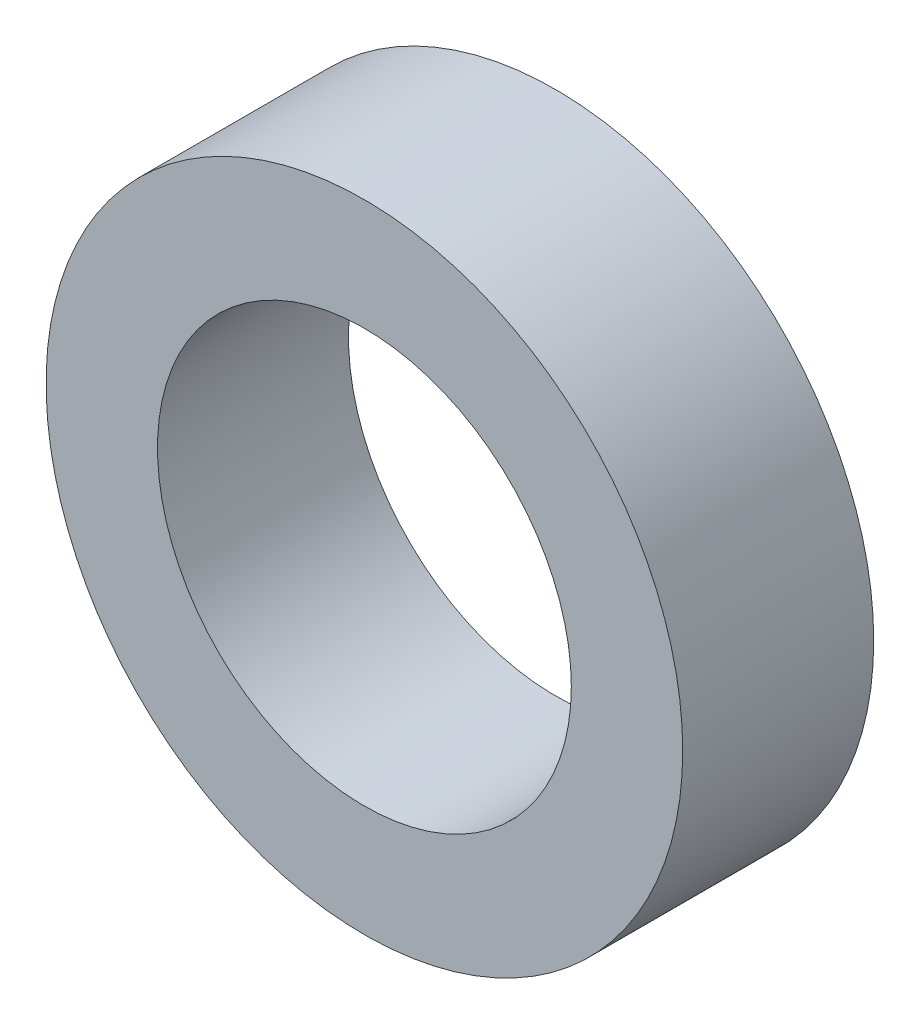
from build123d import *

# Parameters (mm, degrees)
SKETCH1_R           = 5
BOSS_EXTRUDE1_DEPTH = 3
SKETCH2_R           = 3.25
CUT_EXTRUDE1_DEPTH  = 3


with BuildPart() as part:
    # Sketch1 → Boss-Extrude1 (new body)
    with BuildSketch(Plane.XY):
        Circle(SKETCH1_R)
    extrude(amount=BOSS_EXTRUDE1_DEPTH)

    # Sketch2 → Cut-Extrude1 (cut)
    with BuildSketch(Plane.XY.offset(3)):
        Circle(SKETCH2_R)
    extrude(amount=-CUT_EXTRUDE1_DEPTH, mode=Mode.SUBTRACT)


solid = part.part
